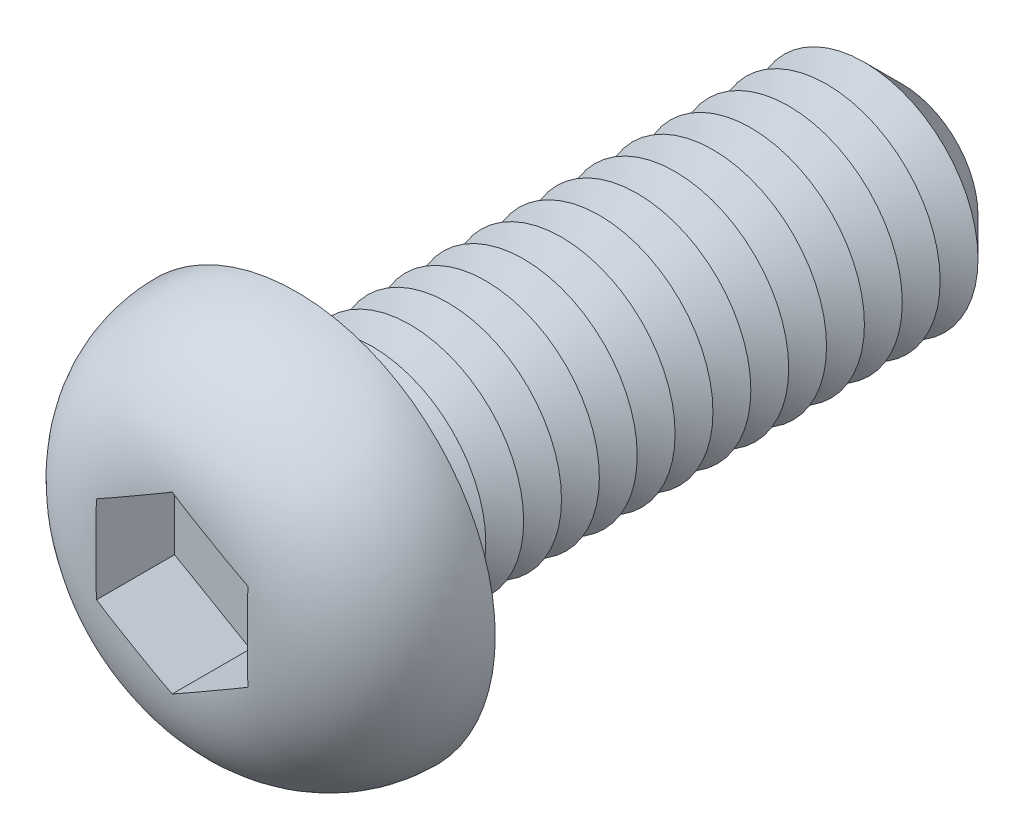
ISO-10303-21;
HEADER;
FILE_DESCRIPTION(('STEP AP214'),'2;1');
FILE_NAME('part.step','',(''),(''),'','','');
FILE_SCHEMA(('AUTOMOTIVE_DESIGN { 1 0 10303 214 1 1 1 1 }'));
ENDSEC;
DATA;
#1=APPLICATION_CONTEXT('core data for automotive mechanical design processes');
#2=APPLICATION_PROTOCOL_DEFINITION('international standard','automotive_design',2000,#1);
#3=PRODUCT_CONTEXT('',#1,'mechanical');
#4=PRODUCT('Part','Part','',(#3));
#5=PRODUCT_RELATED_PRODUCT_CATEGORY('part','',(#4));
#6=PRODUCT_DEFINITION_FORMATION('','',#4);
#7=PRODUCT_DEFINITION_CONTEXT('part definition',#1,'design');
#8=PRODUCT_DEFINITION('design','',#6,#7);
#9=PRODUCT_DEFINITION_SHAPE('','',#8);
#10=(LENGTH_UNIT() NAMED_UNIT(*) SI_UNIT(.MILLI.,.METRE.));
#11=(NAMED_UNIT(*) PLANE_ANGLE_UNIT() SI_UNIT($,.RADIAN.));
#12=(NAMED_UNIT(*) SI_UNIT($,.STERADIAN.) SOLID_ANGLE_UNIT());
#13=UNCERTAINTY_MEASURE_WITH_UNIT(LENGTH_MEASURE(1.E-05),#10,'distance_accuracy_value','');
#14=(GEOMETRIC_REPRESENTATION_CONTEXT(3) GLOBAL_UNCERTAINTY_ASSIGNED_CONTEXT((#13)) GLOBAL_UNIT_ASSIGNED_CONTEXT((#10,
#11,#12)) REPRESENTATION_CONTEXT('',''));
#15=CARTESIAN_POINT('',(0.,0.,0.));
#16=DIRECTION('',(0.,0.,1.));
#17=DIRECTION('',(1.,0.,0.));
#18=AXIS2_PLACEMENT_3D('',#15,#16,#17);
#19=CARTESIAN_POINT('',(0.,0.,-16.));
#20=DIRECTION('',(0.,0.,1.));
#21=DIRECTION('',(1.,0.,0.));
#22=AXIS2_PLACEMENT_3D('',#19,#20,#21);
#23=CYLINDRICAL_SURFACE('',#22,3.);
#24=CARTESIAN_POINT('',(0.,0.,-0.5));
#25=DIRECTION('',(0.,0.,1.));
#26=DIRECTION('',(1.,0.,0.));
#27=AXIS2_PLACEMENT_3D('',#24,#25,#26);
#28=CIRCLE('',#27,3.);
#29=CARTESIAN_POINT('',(3.,0.,-0.5));
#30=VERTEX_POINT('',#29);
#31=EDGE_CURVE('E48',#30,#30,#28,.F.);
#32=ORIENTED_EDGE('',*,*,#31,.T.);
#33=EDGE_LOOP('',(#32));
#34=FACE_BOUND('',#33,.T.);
#35=CARTESIAN_POINT('',(0.,0.,-1.));
#36=DIRECTION('',(0.,0.,1.));
#37=DIRECTION('',(1.,0.,0.));
#38=AXIS2_PLACEMENT_3D('',#35,#36,#37);
#39=CIRCLE('',#38,3.);
#40=CARTESIAN_POINT('',(3.,0.,-1.));
#41=VERTEX_POINT('',#40);
#42=EDGE_CURVE('E118',#41,#41,#39,.T.);
#43=ORIENTED_EDGE('',*,*,#42,.T.);
#44=EDGE_LOOP('',(#43));
#45=FACE_BOUND('',#44,.T.);
#46=ADVANCED_FACE('F39',(#34,#45),#23,.T.);
#47=CARTESIAN_POINT('',(0.,5.25,0.));
#48=DIRECTION('',(0.,0.,1.));
#49=DIRECTION('',(1.,0.,0.));
#50=AXIS2_PLACEMENT_3D('',#47,#48,#49);
#51=PLANE('',#50);
#52=CARTESIAN_POINT('',(0.,0.,0.));
#53=DIRECTION('',(0.,0.,1.));
#54=DIRECTION('',(1.,0.,0.));
#55=AXIS2_PLACEMENT_3D('',#52,#53,#54);
#56=CIRCLE('',#55,3.5);
#57=CARTESIAN_POINT('',(3.5,0.,0.));
#58=VERTEX_POINT('',#57);
#59=EDGE_CURVE('E11',#58,#58,#56,.T.);
#60=ORIENTED_EDGE('',*,*,#59,.T.);
#61=EDGE_LOOP('',(#60));
#62=FACE_BOUND('',#61,.T.);
#63=CARTESIAN_POINT('',(0.,0.,0.));
#64=DIRECTION('',(0.,0.,1.));
#65=DIRECTION('',(1.,0.,0.));
#66=AXIS2_PLACEMENT_3D('',#63,#64,#65);
#67=CIRCLE('',#66,5.25);
#68=CARTESIAN_POINT('',(5.25,0.,0.));
#69=VERTEX_POINT('',#68);
#70=EDGE_CURVE('E142',#69,#69,#67,.T.);
#71=ORIENTED_EDGE('',*,*,#70,.F.);
#72=EDGE_LOOP('',(#71));
#73=FACE_BOUND('',#72,.T.);
#74=ADVANCED_FACE('F218',(#62,#73),#51,.F.);
#75=CARTESIAN_POINT('',(0.,0.,0.));
#76=DIRECTION('',(0.,0.,1.));
#77=DIRECTION('',(1.,0.,0.));
#78=AXIS2_PLACEMENT_3D('',#75,#76,#77);
#79=DEGENERATE_TOROIDAL_SURFACE('',#78,1.95,3.3,.T.);
#80=CARTESIAN_POINT('',(-2.0002,1.15458506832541,3.28035788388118));
#81=CARTESIAN_POINT('',(-1.91691288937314,1.20267090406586,3.28561413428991));
#82=CARTESIAN_POINT('',(-1.83357497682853,1.25078607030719,3.2893341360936));
#83=CARTESIAN_POINT('',(-1.66686712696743,1.34703489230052,3.29467873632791));
#84=CARTESIAN_POINT('',(-1.58349720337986,1.39516854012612,3.29630387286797));
#85=CARTESIAN_POINT('',(-1.4167768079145,1.49142460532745,3.29843721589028));
#86=CARTESIAN_POINT('',(-1.33342633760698,1.53954702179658,3.29894575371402));
#87=CARTESIAN_POINT('',(-1.16671724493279,1.63579656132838,3.29953775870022));
#88=CARTESIAN_POINT('',(-1.0833586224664,1.68392368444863,3.29962119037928));
#89=CARTESIAN_POINT('',(-0.916641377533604,1.78017793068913,3.29962119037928));
#90=CARTESIAN_POINT('',(-0.833282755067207,1.82830505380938,3.29953775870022));
#91=CARTESIAN_POINT('',(-0.666573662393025,1.92455459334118,3.29894575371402));
#92=CARTESIAN_POINT('',(-0.5832231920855,1.97267700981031,3.29843721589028));
#93=CARTESIAN_POINT('',(-0.416502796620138,2.06893307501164,3.29630387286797));
#94=CARTESIAN_POINT('',(-0.333132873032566,2.11706672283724,3.29467873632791));
#95=CARTESIAN_POINT('',(-0.166425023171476,2.21331554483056,3.2893341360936));
#96=CARTESIAN_POINT('',(-0.083087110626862,2.2614307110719,3.28561413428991));
#97=CARTESIAN_POINT('',(0.000200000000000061,2.30951654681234,3.28035788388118));
#98=B_SPLINE_CURVE_WITH_KNOTS('',3,(#80,#81,#82,#83,#84,#85,#86,#87,#88,#89,#90,#91,#92,#93,#94,
#95,#96,#97),.UNSPECIFIED.,.F.,.F.,(4,2,2,2,2,2,2,2,4),(0.,0.288898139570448,0.577722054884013,
0.866460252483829,1.15522255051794,1.44398484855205,1.73272304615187,2.02154696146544,
2.31044510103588),.UNSPECIFIED.);
#99=CARTESIAN_POINT('',(-2.,1.15470053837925,3.28037053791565));
#100=VERTEX_POINT('',#99);
#101=CARTESIAN_POINT('',(0.,2.3094010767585,3.28037053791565));
#102=VERTEX_POINT('',#101);
#103=EDGE_CURVE('E159',#100,#102,#98,.T.);
#104=ORIENTED_EDGE('',*,*,#103,.T.);
#105=CARTESIAN_POINT('',(-0.000199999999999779,2.30951654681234,3.28035788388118));
#106=CARTESIAN_POINT('',(0.0830871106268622,2.2614307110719,3.28561413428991));
#107=CARTESIAN_POINT('',(0.166425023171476,2.21331554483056,3.2893341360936));
#108=CARTESIAN_POINT('',(0.333132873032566,2.11706672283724,3.29467873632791));
#109=CARTESIAN_POINT('',(0.416502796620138,2.06893307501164,3.29630387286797));
#110=CARTESIAN_POINT('',(0.5832231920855,1.97267700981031,3.29843721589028));
#111=CARTESIAN_POINT('',(0.666573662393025,1.92455459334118,3.29894575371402));
#112=CARTESIAN_POINT('',(0.833282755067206,1.82830505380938,3.29953775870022));
#113=CARTESIAN_POINT('',(0.916641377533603,1.78017793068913,3.29962119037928));
#114=CARTESIAN_POINT('',(1.0833586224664,1.68392368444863,3.29962119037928));
#115=CARTESIAN_POINT('',(1.16671724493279,1.63579656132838,3.29953775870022));
#116=CARTESIAN_POINT('',(1.33342633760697,1.53954702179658,3.29894575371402));
#117=CARTESIAN_POINT('',(1.4167768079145,1.49142460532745,3.29843721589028));
#118=CARTESIAN_POINT('',(1.58349720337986,1.39516854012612,3.29630387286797));
#119=CARTESIAN_POINT('',(1.66686712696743,1.34703489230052,3.29467873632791));
#120=CARTESIAN_POINT('',(1.83357497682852,1.25078607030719,3.2893341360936));
#121=CARTESIAN_POINT('',(1.91691288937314,1.20267090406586,3.28561413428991));
#122=CARTESIAN_POINT('',(2.0002,1.15458506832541,3.28035788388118));
#123=B_SPLINE_CURVE_WITH_KNOTS('',3,(#105,#106,#107,#108,#109,#110,#111,#112,#113,#114,#115,
#116,#117,#118,#119,#120,#121,#122),.UNSPECIFIED.,.F.,.F.,(4,2,2,2,2,2,2,2,4),(0.,
0.288898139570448,0.577722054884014,0.866460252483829,1.15522255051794,1.44398484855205,
1.73272304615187,2.02154696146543,2.31044510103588),.UNSPECIFIED.);
#124=CARTESIAN_POINT('',(2.,1.15470053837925,3.28037053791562));
#125=VERTEX_POINT('',#124);
#126=EDGE_CURVE('E98',#102,#125,#123,.T.);
#127=ORIENTED_EDGE('',*,*,#126,.T.);
#128=CARTESIAN_POINT('',(2.,0.,3.29962119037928));
#129=CARTESIAN_POINT('',(2.,-0.083776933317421,3.29962202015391));
#130=CARTESIAN_POINT('',(2.,-0.16755385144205,3.29955399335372));
#131=CARTESIAN_POINT('',(2.,-0.335108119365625,3.29913665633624));
#132=CARTESIAN_POINT('',(2.,-0.418885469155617,3.29878734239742));
#133=CARTESIAN_POINT('',(2.,-0.58647412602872,3.29739645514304));
#134=CARTESIAN_POINT('',(2.,-0.670285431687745,3.29635457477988));
#135=CARTESIAN_POINT('',(2.,-0.83788107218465,3.29299045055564));
#136=CARTESIAN_POINT('',(2.,-0.921665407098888,3.29066821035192));
#137=CARTESIAN_POINT('',(2.,-1.1722454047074,3.2807858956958));
#138=CARTESIAN_POINT('',(2.,-1.33895832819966,3.27031526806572));
#139=CARTESIAN_POINT('',(2.,-1.67103623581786,3.23635494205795));
#140=CARTESIAN_POINT('',(2.,-1.83640244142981,3.21287879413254));
#141=CARTESIAN_POINT('',(2.,-2.10344176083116,3.16074182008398));
#142=CARTESIAN_POINT('',(2.,-2.2061099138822,3.13718731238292));
#143=CARTESIAN_POINT('',(2.,-2.40948794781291,3.08263206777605));
#144=CARTESIAN_POINT('',(2.,-2.51019754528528,3.05163026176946));
#145=CARTESIAN_POINT('',(2.,-2.70894468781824,2.98167613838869));
#146=CARTESIAN_POINT('',(2.,-2.80697949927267,2.94271600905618));
#147=CARTESIAN_POINT('',(2.,-2.9994014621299,2.85662314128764));
#148=CARTESIAN_POINT('',(2.,-3.09378880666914,2.80949083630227));
#149=CARTESIAN_POINT('',(2.,-3.27874879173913,2.70660110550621));
#150=CARTESIAN_POINT('',(2.,-3.36928473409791,2.6507774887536));
#151=CARTESIAN_POINT('',(2.,-3.54476824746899,2.53095107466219));
#152=CARTESIAN_POINT('',(2.,-3.6297163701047,2.46694908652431));
#153=CARTESIAN_POINT('',(2.,-3.79309021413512,2.33110056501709));
#154=CARTESIAN_POINT('',(2.,-3.87151694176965,2.25925524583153));
#155=CARTESIAN_POINT('',(2.,-4.02093628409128,2.10826339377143));
#156=CARTESIAN_POINT('',(2.,-4.09192987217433,2.02911781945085));
#157=CARTESIAN_POINT('',(2.,-4.27732278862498,1.8003635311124));
#158=CARTESIAN_POINT('',(2.,-4.38297261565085,1.64348590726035));
#159=CARTESIAN_POINT('',(2.,-4.564185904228,1.31336862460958));
#160=CARTESIAN_POINT('',(2.,-4.63976443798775,1.14013721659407));
#161=CARTESIAN_POINT('',(2.,-4.75417820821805,0.794488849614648));
#162=CARTESIAN_POINT('',(2.,-4.79509243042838,0.622758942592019));
#163=CARTESIAN_POINT('',(2.,-4.84679751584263,0.274828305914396));
#164=CARTESIAN_POINT('',(2.,-4.85759267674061,0.098628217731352));
#165=CARTESIAN_POINT('',(2.,-4.8487955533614,-0.249157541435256));
#166=CARTESIAN_POINT('',(2.,-4.82985906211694,-0.420760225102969));
#167=CARTESIAN_POINT('',(2.,-4.76345103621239,-0.758322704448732));
#168=CARTESIAN_POINT('',(2.,-4.71598351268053,-0.924283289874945));
#169=CARTESIAN_POINT('',(2.,-4.59404942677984,-1.24604183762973));
#170=CARTESIAN_POINT('',(2.,-4.51956988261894,-1.40183487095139));
#171=CARTESIAN_POINT('',(2.,-4.34600859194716,-1.6990817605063));
#172=CARTESIAN_POINT('',(2.,-4.24691988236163,-1.84053154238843));
#173=CARTESIAN_POINT('',(2.,-4.02493220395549,-2.10847549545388));
#174=CARTESIAN_POINT('',(2.,-3.90156532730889,-2.23458080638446));
#175=CARTESIAN_POINT('',(2.,-3.63636218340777,-2.46550695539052));
#176=CARTESIAN_POINT('',(2.,-3.49453117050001,-2.57033382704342));
#177=CARTESIAN_POINT('',(2.,-3.26713798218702,-2.7130834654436));
#178=CARTESIAN_POINT('',(2.,-3.18660091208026,-2.75923686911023));
#179=CARTESIAN_POINT('',(2.,-3.02216370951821,-2.84520816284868));
#180=CARTESIAN_POINT('',(2.,-2.93826250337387,-2.88502400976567));
#181=CARTESIAN_POINT('',(2.,-2.76779132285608,-2.95832456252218));
#182=CARTESIAN_POINT('',(2.,-2.68122238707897,-2.99181169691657));
#183=CARTESIAN_POINT('',(2.,-2.50604626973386,-3.05263810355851));
#184=CARTESIAN_POINT('',(2.,-2.41744088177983,-3.07998257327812));
#185=CARTESIAN_POINT('',(2.,-2.20396420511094,-3.13835394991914));
#186=CARTESIAN_POINT('',(2.,-2.07835656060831,-3.16669536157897));
#187=CARTESIAN_POINT('',(2.,-1.82529007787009,-3.2134938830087));
#188=CARTESIAN_POINT('',(2.,-1.69783012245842,-3.23194474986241));
#189=CARTESIAN_POINT('',(2.,-1.44149598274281,-3.26083645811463));
#190=CARTESIAN_POINT('',(2.,-1.31261808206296,-3.27124272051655));
#191=CARTESIAN_POINT('',(2.,-1.05456848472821,-3.28623769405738));
#192=CARTESIAN_POINT('',(2.,-0.925396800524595,-3.29082664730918));
#193=CARTESIAN_POINT('',(2.,-0.665550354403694,-3.29674923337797));
#194=CARTESIAN_POINT('',(2.,-0.53487497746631,-3.29804579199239));
#195=CARTESIAN_POINT('',(2.,-0.273526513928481,-3.29947536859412));
#196=CARTESIAN_POINT('',(2.,-0.142853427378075,-3.29960842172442));
#197=CARTESIAN_POINT('',(2.,0.118243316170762,-3.29963281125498));
#198=CARTESIAN_POINT('',(2.,0.248666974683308,-3.29952460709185));
#199=CARTESIAN_POINT('',(2.,0.509509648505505,-3.29825409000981));
#200=CARTESIAN_POINT('',(2.,0.639928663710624,-3.29709183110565));
#201=CARTESIAN_POINT('',(2.,0.831730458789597,-3.29304171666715));
#202=CARTESIAN_POINT('',(2.,0.89313616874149,-3.29139197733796));
#203=CARTESIAN_POINT('',(2.,1.01591282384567,-3.28711504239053));
#204=CARTESIAN_POINT('',(2.,1.07728376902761,-3.28448784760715));
#205=CARTESIAN_POINT('',(2.,1.26131335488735,-3.27473407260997));
#206=CARTESIAN_POINT('',(2.,1.38388698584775,-3.2657353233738));
#207=CARTESIAN_POINT('',(2.,1.62750125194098,-3.24079239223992));
#208=CARTESIAN_POINT('',(2.,1.74854662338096,-3.22489680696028));
#209=CARTESIAN_POINT('',(2.,1.98924449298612,-3.18452451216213));
#210=CARTESIAN_POINT('',(2.,2.10889688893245,-3.16004717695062));
#211=CARTESIAN_POINT('',(2.,2.34827145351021,-3.10067973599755));
#212=CARTESIAN_POINT('',(2.,2.46794336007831,-3.06558373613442));
#213=CARTESIAN_POINT('',(2.,2.70350765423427,-2.98433995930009));
#214=CARTESIAN_POINT('',(2.,2.8194000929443,-2.9381923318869));
#215=CARTESIAN_POINT('',(2.,3.0462872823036,-2.83430045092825));
#216=CARTESIAN_POINT('',(2.,3.157267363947,-2.77652399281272));
#217=CARTESIAN_POINT('',(2.,3.37244069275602,-2.64945989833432));
#218=CARTESIAN_POINT('',(2.,3.47663511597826,-2.58017426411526));
#219=CARTESIAN_POINT('',(2.,3.66184410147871,-2.44158969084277));
#220=CARTESIAN_POINT('',(2.,3.74400419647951,-2.37381785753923));
#221=CARTESIAN_POINT('',(2.,3.90136233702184,-2.23063102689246));
#222=CARTESIAN_POINT('',(2.,3.9765614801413,-2.1552172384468));
#223=CARTESIAN_POINT('',(2.,4.11902811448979,-1.99742327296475));
#224=CARTESIAN_POINT('',(2.,4.18630715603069,-1.91505354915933));
#225=CARTESIAN_POINT('',(2.,4.31224227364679,-1.74401295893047));
#226=CARTESIAN_POINT('',(2.,4.37089943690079,-1.65534288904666));
#227=CARTESIAN_POINT('',(2.,4.51742320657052,-1.40720395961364));
#228=CARTESIAN_POINT('',(2.,4.59632371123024,-1.24230503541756));
#229=CARTESIAN_POINT('',(2.,4.72377654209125,-0.901269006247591));
#230=CARTESIAN_POINT('',(2.,4.77233626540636,-0.725134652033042));
#231=CARTESIAN_POINT('',(2.,4.83594291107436,-0.375162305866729));
#232=CARTESIAN_POINT('',(2.,4.85240855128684,-0.201581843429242));
#233=CARTESIAN_POINT('',(2.,4.85558073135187,0.145835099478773));
#234=CARTESIAN_POINT('',(2.,4.8422910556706,0.319671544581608));
#235=CARTESIAN_POINT('',(2.,4.78674180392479,0.660539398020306));
#236=CARTESIAN_POINT('',(2.,4.74482430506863,0.827626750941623));
#237=CARTESIAN_POINT('',(2.,4.63375789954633,1.15246461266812));
#238=CARTESIAN_POINT('',(2.,4.56461058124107,1.31021566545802));
#239=CARTESIAN_POINT('',(2.,4.40063624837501,1.61344814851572));
#240=CARTESIAN_POINT('',(2.,4.30559842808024,1.75881539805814));
#241=CARTESIAN_POINT('',(2.,4.09315528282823,2.03216183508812));
#242=CARTESIAN_POINT('',(2.,3.97574503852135,2.16013718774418));
#243=CARTESIAN_POINT('',(2.,3.71810418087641,2.3997527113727));
#244=CARTESIAN_POINT('',(2.,3.57725563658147,2.51072635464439));
#245=CARTESIAN_POINT('',(2.,3.28005668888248,2.70933274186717));
#246=CARTESIAN_POINT('',(2.,3.12370896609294,2.79696951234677));
#247=CARTESIAN_POINT('',(2.,2.85462284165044,2.92305372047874));
#248=CARTESIAN_POINT('',(2.,2.74490899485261,2.96813077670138));
#249=CARTESIAN_POINT('',(2.,2.52184151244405,3.04824715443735));
#250=CARTESIAN_POINT('',(2.,2.40848685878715,3.08328364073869));
#251=CARTESIAN_POINT('',(2.,2.17918323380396,3.14397693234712));
#252=CARTESIAN_POINT('',(2.,2.06323128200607,3.16962230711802));
#253=CARTESIAN_POINT('',(2.,1.82982653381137,3.21251895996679));
#254=CARTESIAN_POINT('',(2.,1.71237385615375,3.229770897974));
#255=CARTESIAN_POINT('',(2.,1.46252543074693,3.2589582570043));
#256=CARTESIAN_POINT('',(2.,1.3300298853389,3.27000580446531));
#257=CARTESIAN_POINT('',(2.,1.0646774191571,3.28585371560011));
#258=CARTESIAN_POINT('',(2.,0.931820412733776,3.29065244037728));
#259=CARTESIAN_POINT('',(2.,0.665789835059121,3.29677132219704));
#260=CARTESIAN_POINT('',(2.,0.532616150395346,3.29808470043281));
#261=CARTESIAN_POINT('',(2.,0.332868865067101,3.29913679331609));
#262=CARTESIAN_POINT('',(2.,0.266295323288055,3.2993345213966));
#263=CARTESIAN_POINT('',(2.,0.133147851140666,3.29957639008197));
#264=CARTESIAN_POINT('',(2.,0.0665739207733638,3.29962053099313));
#265=CARTESIAN_POINT('',(2.,0.,3.29962119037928));
#266=B_SPLINE_CURVE_WITH_KNOTS('',3,(#128,#129,#130,#131,#132,#133,#134,#135,#136,#137,#138,
#139,#140,#141,#142,#143,#144,#145,#146,#147,#148,#149,#150,#151,#152,#153,#154,#155,#156,#157,
#158,#159,#160,#161,#162,#163,#164,#165,#166,#167,#168,#169,#170,#171,#172,#173,#174,#175,#176,
#177,#178,#179,#180,#181,#182,#183,#184,#185,#186,#187,#188,#189,#190,#191,#192,#193,#194,#195,
#196,#197,#198,#199,#200,#201,#202,#203,#204,#205,#206,#207,#208,#209,#210,#211,#212,#213,#214,
#215,#216,#217,#218,#219,#220,#221,#222,#223,#224,#225,#226,#227,#228,#229,#230,#231,#232,#233,
#234,#235,#236,#237,#238,#239,#240,#241,#242,#243,#244,#245,#246,#247,#248,#249,#250,#251,#252,
#253,#254,#255,#256,#257,#258,#259,#260,#261,#262,#263,#264,#265),.UNSPECIFIED.,.T.,.F.,(4,2,2,
2,2,2,2,2,2,2,2,2,2,2,2,2,2,2,2,2,2,2,2,2,2,2,2,2,2,2,2,2,2,2,2,2,2,2,2,2,2,2,2,2,2,2,2,2,2,2,2,
2,2,2,2,2,2,2,2,2,2,2,2,2,2,2,2,2,4),(0.,0.251330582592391,0.502664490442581,0.754109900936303,
1.00555459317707,1.50637447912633,2.00667353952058,2.32243701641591,2.63824585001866,
2.95436618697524,3.27046976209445,3.58911045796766,3.90771965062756,4.22627959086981,
4.5447977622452,5.10896009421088,5.67283930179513,6.19985685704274,6.72679920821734,
7.24228104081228,7.75769041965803,8.27334782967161,8.78915130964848,9.3160918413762,
9.84288274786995,10.1211212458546,10.3994492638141,10.6776702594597,10.9556549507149,
11.3414617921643,11.727511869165,12.1152122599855,12.5028965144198,12.8949273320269,
13.2869463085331,13.6782193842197,14.0694724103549,14.2537488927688,14.4380252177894,
14.8065831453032,15.1725852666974,15.5386140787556,15.9122523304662,16.28588552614,
16.6605680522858,17.0351854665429,17.3542226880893,17.6732095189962,17.9917252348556,
18.3102007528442,18.8555909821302,19.4008481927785,19.9214008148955,20.4418872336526,
20.9562606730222,21.4706041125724,21.9892675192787,22.5080451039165,23.0436926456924,
23.5792477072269,23.9346277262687,24.2901079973,24.6460195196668,25.0019030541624,
25.4005476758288,25.7992968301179,26.1988209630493,26.3985429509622,26.5982645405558),.UNSPECIFIED.);
#267=CARTESIAN_POINT('',(2.,-1.15470053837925,3.28037053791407));
#268=VERTEX_POINT('',#267);
#269=EDGE_CURVE('E63',#125,#268,#266,.T.);
#270=ORIENTED_EDGE('',*,*,#269,.T.);
#271=CARTESIAN_POINT('',(2.0002,-1.15458506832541,3.28035788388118));
#272=CARTESIAN_POINT('',(1.91691288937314,-1.20267090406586,3.28561413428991));
#273=CARTESIAN_POINT('',(1.83357497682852,-1.25078607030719,3.2893341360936));
#274=CARTESIAN_POINT('',(1.66686712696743,-1.34703489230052,3.29467873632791));
#275=CARTESIAN_POINT('',(1.58349720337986,-1.39516854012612,3.29630387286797));
#276=CARTESIAN_POINT('',(1.4167768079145,-1.49142460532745,3.29843721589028));
#277=CARTESIAN_POINT('',(1.33342633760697,-1.53954702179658,3.29894575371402));
#278=CARTESIAN_POINT('',(1.16671724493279,-1.63579656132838,3.29953775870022));
#279=CARTESIAN_POINT('',(1.0833586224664,-1.68392368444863,3.29962119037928));
#280=CARTESIAN_POINT('',(0.916641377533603,-1.78017793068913,3.29962119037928));
#281=CARTESIAN_POINT('',(0.833282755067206,-1.82830505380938,3.29953775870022));
#282=CARTESIAN_POINT('',(0.666573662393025,-1.92455459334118,3.29894575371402));
#283=CARTESIAN_POINT('',(0.5832231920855,-1.97267700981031,3.29843721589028));
#284=CARTESIAN_POINT('',(0.416502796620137,-2.06893307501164,3.29630387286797));
#285=CARTESIAN_POINT('',(0.333132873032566,-2.11706672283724,3.29467873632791));
#286=CARTESIAN_POINT('',(0.166425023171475,-2.21331554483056,3.2893341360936));
#287=CARTESIAN_POINT('',(0.0830871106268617,-2.2614307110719,3.28561413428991));
#288=CARTESIAN_POINT('',(-0.000200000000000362,-2.30951654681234,3.28035788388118));
#289=B_SPLINE_CURVE_WITH_KNOTS('',3,(#271,#272,#273,#274,#275,#276,#277,#278,#279,#280,#281,
#282,#283,#284,#285,#286,#287,#288),.UNSPECIFIED.,.F.,.F.,(4,2,2,2,2,2,2,2,4),(0.,
0.288898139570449,0.577722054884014,0.86646025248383,1.15522255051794,1.44398484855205,
1.73272304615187,2.02154696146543,2.31044510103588),.UNSPECIFIED.);
#290=CARTESIAN_POINT('',(0.,-2.3094010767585,3.28037053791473));
#291=VERTEX_POINT('',#290);
#292=EDGE_CURVE('E239',#268,#291,#289,.T.);
#293=ORIENTED_EDGE('',*,*,#292,.T.);
#294=CARTESIAN_POINT('',(0.000199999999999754,-2.30951654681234,3.28035788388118));
#295=CARTESIAN_POINT('',(-0.0830871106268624,-2.2614307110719,3.28561413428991));
#296=CARTESIAN_POINT('',(-0.166425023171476,-2.21331554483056,3.2893341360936));
#297=CARTESIAN_POINT('',(-0.333132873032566,-2.11706672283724,3.29467873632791));
#298=CARTESIAN_POINT('',(-0.416502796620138,-2.06893307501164,3.29630387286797));
#299=CARTESIAN_POINT('',(-0.5832231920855,-1.97267700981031,3.29843721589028));
#300=CARTESIAN_POINT('',(-0.666573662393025,-1.92455459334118,3.29894575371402));
#301=CARTESIAN_POINT('',(-0.833282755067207,-1.82830505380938,3.29953775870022));
#302=CARTESIAN_POINT('',(-0.916641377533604,-1.78017793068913,3.29962119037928));
#303=CARTESIAN_POINT('',(-1.0833586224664,-1.68392368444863,3.29962119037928));
#304=CARTESIAN_POINT('',(-1.16671724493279,-1.63579656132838,3.29953775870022));
#305=CARTESIAN_POINT('',(-1.33342633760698,-1.53954702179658,3.29894575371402));
#306=CARTESIAN_POINT('',(-1.4167768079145,-1.49142460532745,3.29843721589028));
#307=CARTESIAN_POINT('',(-1.58349720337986,-1.39516854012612,3.29630387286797));
#308=CARTESIAN_POINT('',(-1.66686712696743,-1.34703489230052,3.29467873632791));
#309=CARTESIAN_POINT('',(-1.83357497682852,-1.25078607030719,3.2893341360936));
#310=CARTESIAN_POINT('',(-1.91691288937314,-1.20267090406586,3.28561413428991));
#311=CARTESIAN_POINT('',(-2.0002,-1.15458506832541,3.28035788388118));
#312=B_SPLINE_CURVE_WITH_KNOTS('',3,(#294,#295,#296,#297,#298,#299,#300,#301,#302,#303,#304,
#305,#306,#307,#308,#309,#310,#311),.UNSPECIFIED.,.F.,.F.,(4,2,2,2,2,2,2,2,4),(0.,
0.288898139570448,0.577722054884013,0.866460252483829,1.15522255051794,1.44398484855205,
1.73272304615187,2.02154696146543,2.31044510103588),.UNSPECIFIED.);
#313=CARTESIAN_POINT('',(-2.,-1.15470053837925,3.28037053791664));
#314=VERTEX_POINT('',#313);
#315=EDGE_CURVE('E245',#291,#314,#312,.T.);
#316=ORIENTED_EDGE('',*,*,#315,.T.);
#317=CARTESIAN_POINT('',(-2.,0.,3.29962119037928));
#318=CARTESIAN_POINT('',(-2.,0.083776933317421,3.29962202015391));
#319=CARTESIAN_POINT('',(-2.,0.16755385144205,3.29955399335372));
#320=CARTESIAN_POINT('',(-2.,0.335108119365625,3.29913665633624));
#321=CARTESIAN_POINT('',(-2.,0.418885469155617,3.29878734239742));
#322=CARTESIAN_POINT('',(-2.,0.58647412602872,3.29739645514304));
#323=CARTESIAN_POINT('',(-2.,0.670285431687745,3.29635457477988));
#324=CARTESIAN_POINT('',(-2.,0.83788107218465,3.29299045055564));
#325=CARTESIAN_POINT('',(-2.,0.921665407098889,3.29066821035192));
#326=CARTESIAN_POINT('',(-2.,1.1722454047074,3.2807858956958));
#327=CARTESIAN_POINT('',(-2.,1.33895832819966,3.27031526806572));
#328=CARTESIAN_POINT('',(-2.,1.67103623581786,3.23635494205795));
#329=CARTESIAN_POINT('',(-2.,1.83640244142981,3.21287879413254));
#330=CARTESIAN_POINT('',(-2.,2.10344176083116,3.16074182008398));
#331=CARTESIAN_POINT('',(-2.,2.2061099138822,3.13718731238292));
#332=CARTESIAN_POINT('',(-2.,2.40948794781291,3.08263206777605));
#333=CARTESIAN_POINT('',(-2.,2.51019754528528,3.05163026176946));
#334=CARTESIAN_POINT('',(-2.,2.70894468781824,2.98167613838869));
#335=CARTESIAN_POINT('',(-2.,2.80697949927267,2.94271600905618));
#336=CARTESIAN_POINT('',(-2.,2.9994014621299,2.85662314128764));
#337=CARTESIAN_POINT('',(-2.,3.09378880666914,2.80949083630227));
#338=CARTESIAN_POINT('',(-2.,3.27874879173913,2.70660110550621));
#339=CARTESIAN_POINT('',(-2.,3.36928473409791,2.6507774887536));
#340=CARTESIAN_POINT('',(-2.,3.54476824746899,2.53095107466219));
#341=CARTESIAN_POINT('',(-2.,3.6297163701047,2.46694908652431));
#342=CARTESIAN_POINT('',(-2.,3.79309021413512,2.33110056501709));
#343=CARTESIAN_POINT('',(-2.,3.87151694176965,2.25925524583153));
#344=CARTESIAN_POINT('',(-2.,4.02093628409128,2.10826339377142));
#345=CARTESIAN_POINT('',(-2.,4.09192987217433,2.02911781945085));
#346=CARTESIAN_POINT('',(-2.,4.27732278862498,1.8003635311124));
#347=CARTESIAN_POINT('',(-2.,4.38297261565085,1.64348590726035));
#348=CARTESIAN_POINT('',(-2.,4.564185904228,1.31336862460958));
#349=CARTESIAN_POINT('',(-2.,4.63976443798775,1.14013721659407));
#350=CARTESIAN_POINT('',(-2.,4.75417820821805,0.794488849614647));
#351=CARTESIAN_POINT('',(-2.,4.79509243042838,0.622758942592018));
#352=CARTESIAN_POINT('',(-2.,4.84679751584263,0.274828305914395));
#353=CARTESIAN_POINT('',(-2.,4.85759267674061,0.0986282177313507));
#354=CARTESIAN_POINT('',(-2.,4.8487955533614,-0.249157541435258));
#355=CARTESIAN_POINT('',(-2.,4.82985906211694,-0.42076022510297));
#356=CARTESIAN_POINT('',(-2.,4.76345103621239,-0.758322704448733));
#357=CARTESIAN_POINT('',(-2.,4.71598351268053,-0.924283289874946));
#358=CARTESIAN_POINT('',(-2.,4.59404942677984,-1.24604183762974));
#359=CARTESIAN_POINT('',(-2.,4.51956988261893,-1.40183487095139));
#360=CARTESIAN_POINT('',(-2.,4.34600859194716,-1.6990817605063));
#361=CARTESIAN_POINT('',(-2.,4.24691988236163,-1.84053154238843));
#362=CARTESIAN_POINT('',(-2.,4.02493220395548,-2.10847549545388));
#363=CARTESIAN_POINT('',(-2.,3.90156532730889,-2.23458080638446));
#364=CARTESIAN_POINT('',(-2.,3.63636218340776,-2.46550695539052));
#365=CARTESIAN_POINT('',(-2.,3.49453117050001,-2.57033382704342));
#366=CARTESIAN_POINT('',(-2.,3.26713798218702,-2.7130834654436));
#367=CARTESIAN_POINT('',(-2.,3.18660091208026,-2.75923686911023));
#368=CARTESIAN_POINT('',(-2.,3.02216370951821,-2.84520816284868));
#369=CARTESIAN_POINT('',(-2.,2.93826250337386,-2.88502400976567));
#370=CARTESIAN_POINT('',(-2.,2.76779132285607,-2.95832456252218));
#371=CARTESIAN_POINT('',(-2.,2.68122238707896,-2.99181169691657));
#372=CARTESIAN_POINT('',(-2.,2.50604626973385,-3.05263810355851));
#373=CARTESIAN_POINT('',(-2.,2.41744088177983,-3.07998257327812));
#374=CARTESIAN_POINT('',(-2.,2.20396420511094,-3.13835394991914));
#375=CARTESIAN_POINT('',(-2.,2.0783565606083,-3.16669536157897));
#376=CARTESIAN_POINT('',(-2.,1.82529007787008,-3.2134938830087));
#377=CARTESIAN_POINT('',(-2.,1.69783012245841,-3.23194474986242));
#378=CARTESIAN_POINT('',(-2.,1.4414959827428,-3.26083645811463));
#379=CARTESIAN_POINT('',(-2.,1.31261808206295,-3.27124272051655));
#380=CARTESIAN_POINT('',(-2.,1.0545684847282,-3.28623769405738));
#381=CARTESIAN_POINT('',(-2.,0.925396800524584,-3.29082664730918));
#382=CARTESIAN_POINT('',(-2.,0.665550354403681,-3.29674923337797));
#383=CARTESIAN_POINT('',(-2.,0.534874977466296,-3.29804579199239));
#384=CARTESIAN_POINT('',(-2.,0.273526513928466,-3.29947536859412));
#385=CARTESIAN_POINT('',(-2.,0.142853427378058,-3.29960842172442));
#386=CARTESIAN_POINT('',(-2.,-0.11824331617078,-3.29963281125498));
#387=CARTESIAN_POINT('',(-2.,-0.248666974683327,-3.29952460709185));
#388=CARTESIAN_POINT('',(-2.,-0.509509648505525,-3.29825409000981));
#389=CARTESIAN_POINT('',(-2.,-0.639928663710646,-3.29709183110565));
#390=CARTESIAN_POINT('',(-2.,-0.83173045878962,-3.29304171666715));
#391=CARTESIAN_POINT('',(-2.,-0.893136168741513,-3.29139197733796));
#392=CARTESIAN_POINT('',(-2.,-1.0159128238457,-3.28711504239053));
#393=CARTESIAN_POINT('',(-2.,-1.07728376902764,-3.28448784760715));
#394=CARTESIAN_POINT('',(-2.,-1.26131335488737,-3.27473407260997));
#395=CARTESIAN_POINT('',(-2.,-1.38388698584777,-3.2657353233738));
#396=CARTESIAN_POINT('',(-2.,-1.627501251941,-3.24079239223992));
#397=CARTESIAN_POINT('',(-2.,-1.74854662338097,-3.22489680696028));
#398=CARTESIAN_POINT('',(-2.,-1.98924449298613,-3.18452451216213));
#399=CARTESIAN_POINT('',(-2.,-2.10889688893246,-3.16004717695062));
#400=CARTESIAN_POINT('',(-2.,-2.34827145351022,-3.10067973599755));
#401=CARTESIAN_POINT('',(-2.,-2.46794336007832,-3.06558373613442));
#402=CARTESIAN_POINT('',(-2.,-2.70350765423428,-2.98433995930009));
#403=CARTESIAN_POINT('',(-2.,-2.81940009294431,-2.93819233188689));
#404=CARTESIAN_POINT('',(-2.,-3.0462872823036,-2.83430045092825));
#405=CARTESIAN_POINT('',(-2.,-3.157267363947,-2.77652399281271));
#406=CARTESIAN_POINT('',(-2.,-3.37244069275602,-2.64945989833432));
#407=CARTESIAN_POINT('',(-2.,-3.47663511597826,-2.58017426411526));
#408=CARTESIAN_POINT('',(-2.,-3.66184410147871,-2.44158969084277));
#409=CARTESIAN_POINT('',(-2.,-3.74400419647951,-2.37381785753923));
#410=CARTESIAN_POINT('',(-2.,-3.90136233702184,-2.23063102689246));
#411=CARTESIAN_POINT('',(-2.,-3.9765614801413,-2.1552172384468));
#412=CARTESIAN_POINT('',(-2.,-4.11902811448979,-1.99742327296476));
#413=CARTESIAN_POINT('',(-2.,-4.18630715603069,-1.91505354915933));
#414=CARTESIAN_POINT('',(-2.,-4.31224227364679,-1.74401295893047));
#415=CARTESIAN_POINT('',(-2.,-4.37089943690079,-1.65534288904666));
#416=CARTESIAN_POINT('',(-2.,-4.51742320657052,-1.40720395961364));
#417=CARTESIAN_POINT('',(-2.,-4.59632371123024,-1.24230503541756));
#418=CARTESIAN_POINT('',(-2.,-4.72377654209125,-0.901269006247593));
#419=CARTESIAN_POINT('',(-2.,-4.77233626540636,-0.725134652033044));
#420=CARTESIAN_POINT('',(-2.,-4.83594291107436,-0.37516230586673));
#421=CARTESIAN_POINT('',(-2.,-4.85240855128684,-0.201581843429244));
#422=CARTESIAN_POINT('',(-2.,-4.85558073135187,0.145835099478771));
#423=CARTESIAN_POINT('',(-2.,-4.8422910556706,0.319671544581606));
#424=CARTESIAN_POINT('',(-2.,-4.78674180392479,0.660539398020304));
#425=CARTESIAN_POINT('',(-2.,-4.74482430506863,0.827626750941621));
#426=CARTESIAN_POINT('',(-2.,-4.63375789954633,1.15246461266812));
#427=CARTESIAN_POINT('',(-2.,-4.56461058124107,1.31021566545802));
#428=CARTESIAN_POINT('',(-2.,-4.40063624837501,1.61344814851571));
#429=CARTESIAN_POINT('',(-2.,-4.30559842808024,1.75881539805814));
#430=CARTESIAN_POINT('',(-2.,-4.09315528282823,2.03216183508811));
#431=CARTESIAN_POINT('',(-2.,-3.97574503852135,2.16013718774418));
#432=CARTESIAN_POINT('',(-2.,-3.71810418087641,2.39975271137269));
#433=CARTESIAN_POINT('',(-2.,-3.57725563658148,2.51072635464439));
#434=CARTESIAN_POINT('',(-2.,-3.28005668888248,2.70933274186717));
#435=CARTESIAN_POINT('',(-2.,-3.12370896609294,2.79696951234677));
#436=CARTESIAN_POINT('',(-2.,-2.85462284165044,2.92305372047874));
#437=CARTESIAN_POINT('',(-2.,-2.74490899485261,2.96813077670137));
#438=CARTESIAN_POINT('',(-2.,-2.52184151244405,3.04824715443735));
#439=CARTESIAN_POINT('',(-2.,-2.40848685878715,3.08328364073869));
#440=CARTESIAN_POINT('',(-2.,-2.17918323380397,3.14397693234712));
#441=CARTESIAN_POINT('',(-2.,-2.06323128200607,3.16962230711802));
#442=CARTESIAN_POINT('',(-2.,-1.82982653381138,3.21251895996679));
#443=CARTESIAN_POINT('',(-2.,-1.71237385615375,3.229770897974));
#444=CARTESIAN_POINT('',(-2.,-1.46252543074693,3.2589582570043));
#445=CARTESIAN_POINT('',(-2.,-1.33002988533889,3.27000580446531));
#446=CARTESIAN_POINT('',(-2.,-1.0646774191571,3.28585371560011));
#447=CARTESIAN_POINT('',(-2.,-0.931820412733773,3.29065244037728));
#448=CARTESIAN_POINT('',(-2.,-0.66578983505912,3.29677132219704));
#449=CARTESIAN_POINT('',(-2.,-0.532616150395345,3.29808470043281));
#450=CARTESIAN_POINT('',(-2.,-0.332868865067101,3.29913679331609));
#451=CARTESIAN_POINT('',(-2.,-0.266295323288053,3.2993345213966));
#452=CARTESIAN_POINT('',(-2.,-0.133147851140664,3.29957639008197));
#453=CARTESIAN_POINT('',(-2.,-0.0665739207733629,3.29962053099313));
#454=CARTESIAN_POINT('',(-2.,0.,3.29962119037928));
#455=B_SPLINE_CURVE_WITH_KNOTS('',3,(#317,#318,#319,#320,#321,#322,#323,#324,#325,#326,#327,
#328,#329,#330,#331,#332,#333,#334,#335,#336,#337,#338,#339,#340,#341,#342,#343,#344,#345,#346,
#347,#348,#349,#350,#351,#352,#353,#354,#355,#356,#357,#358,#359,#360,#361,#362,#363,#364,#365,
#366,#367,#368,#369,#370,#371,#372,#373,#374,#375,#376,#377,#378,#379,#380,#381,#382,#383,#384,
#385,#386,#387,#388,#389,#390,#391,#392,#393,#394,#395,#396,#397,#398,#399,#400,#401,#402,#403,
#404,#405,#406,#407,#408,#409,#410,#411,#412,#413,#414,#415,#416,#417,#418,#419,#420,#421,#422,
#423,#424,#425,#426,#427,#428,#429,#430,#431,#432,#433,#434,#435,#436,#437,#438,#439,#440,#441,
#442,#443,#444,#445,#446,#447,#448,#449,#450,#451,#452,#453,#454),.UNSPECIFIED.,.T.,.F.,(4,2,2,
2,2,2,2,2,2,2,2,2,2,2,2,2,2,2,2,2,2,2,2,2,2,2,2,2,2,2,2,2,2,2,2,2,2,2,2,2,2,2,2,2,2,2,2,2,2,2,2,
2,2,2,2,2,2,2,2,2,2,2,2,2,2,2,2,2,4),(0.,0.251330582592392,0.502664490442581,0.754109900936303,
1.00555459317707,1.50637447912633,2.00667353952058,2.32243701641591,2.63824585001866,
2.95436618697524,3.27046976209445,3.58911045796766,3.90771965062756,4.22627959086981,
4.5447977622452,5.10896009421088,5.67283930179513,6.19985685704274,6.72679920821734,
7.24228104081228,7.75769041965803,8.27334782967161,8.78915130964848,9.3160918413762,
9.84288274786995,10.1211212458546,10.3994492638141,10.6776702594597,10.9556549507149,
11.3414617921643,11.727511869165,12.1152122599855,12.5028965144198,12.8949273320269,
13.2869463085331,13.6782193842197,14.0694724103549,14.2537488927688,14.4380252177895,
14.8065831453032,15.1725852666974,15.5386140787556,15.9122523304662,16.28588552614,
16.6605680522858,17.0351854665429,17.3542226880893,17.6732095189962,17.9917252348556,
18.3102007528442,18.8555909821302,19.4008481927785,19.9214008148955,20.4418872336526,
20.9562606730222,21.4706041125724,21.9892675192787,22.5080451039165,23.0436926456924,
23.5792477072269,23.9346277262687,24.2901079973,24.6460195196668,25.0019030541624,
25.4005476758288,25.7992968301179,26.1988209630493,26.3985429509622,26.5982645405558),.UNSPECIFIED.);
#456=EDGE_CURVE('E166',#314,#100,#455,.T.);
#457=ORIENTED_EDGE('',*,*,#456,.T.);
#458=EDGE_LOOP('',(#104,#127,#270,#293,#316,#457));
#459=FACE_BOUND('',#458,.T.);
#460=ORIENTED_EDGE('',*,*,#70,.T.);
#461=EDGE_LOOP('',(#460));
#462=FACE_BOUND('',#461,.T.);
#463=ADVANCED_FACE('F171',(#459,#462),#79,.T.);
#464=CARTESIAN_POINT('',(2.,1.15470053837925,1.22));
#465=DIRECTION('',(0.5,0.866025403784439,0.));
#466=DIRECTION('',(-0.866025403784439,0.5,0.));
#467=AXIS2_PLACEMENT_3D('',#464,#465,#466);
#468=PLANE('',#467);
#469=DIRECTION('',(0.,0.,1.));
#470=VECTOR('',#469,1.);
#471=CARTESIAN_POINT('',(0.,2.3094010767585,1.22));
#472=LINE('',#471,#470);
#473=CARTESIAN_POINT('',(0.,2.3094010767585,1.22));
#474=VERTEX_POINT('',#473);
#475=EDGE_CURVE('E55',#474,#102,#472,.T.);
#476=ORIENTED_EDGE('',*,*,#475,.F.);
#477=DIRECTION('',(-0.866025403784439,0.5,0.));
#478=VECTOR('',#477,1.);
#479=CARTESIAN_POINT('',(2.,1.15470053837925,1.22));
#480=LINE('',#479,#478);
#481=CARTESIAN_POINT('',(2.,1.15470053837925,1.22));
#482=VERTEX_POINT('',#481);
#483=EDGE_CURVE('E95',#482,#474,#480,.T.);
#484=ORIENTED_EDGE('',*,*,#483,.F.);
#485=DIRECTION('',(0.,0.,1.));
#486=VECTOR('',#485,1.);
#487=CARTESIAN_POINT('',(2.,1.15470053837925,1.22));
#488=LINE('',#487,#486);
#489=EDGE_CURVE('E139',#482,#125,#488,.T.);
#490=ORIENTED_EDGE('',*,*,#489,.T.);
#491=ORIENTED_EDGE('',*,*,#126,.F.);
#492=EDGE_LOOP('',(#476,#484,#490,#491));
#493=FACE_BOUND('',#492,.T.);
#494=ADVANCED_FACE('F93',(#493),#468,.F.);
#495=CARTESIAN_POINT('',(2.,-1.15470053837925,1.22));
#496=DIRECTION('',(1.,0.,0.));
#497=DIRECTION('',(0.,1.,0.));
#498=AXIS2_PLACEMENT_3D('',#495,#496,#497);
#499=PLANE('',#498);
#500=ORIENTED_EDGE('',*,*,#489,.F.);
#501=DIRECTION('',(0.,1.,0.));
#502=VECTOR('',#501,1.);
#503=CARTESIAN_POINT('',(2.,-1.15470053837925,1.22));
#504=LINE('',#503,#502);
#505=CARTESIAN_POINT('',(2.,-1.15470053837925,1.22));
#506=VERTEX_POINT('',#505);
#507=EDGE_CURVE('E102',#506,#482,#504,.T.);
#508=ORIENTED_EDGE('',*,*,#507,.F.);
#509=DIRECTION('',(0.,0.,1.));
#510=VECTOR('',#509,1.);
#511=CARTESIAN_POINT('',(2.,-1.15470053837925,1.22));
#512=LINE('',#511,#510);
#513=EDGE_CURVE('E143',#506,#268,#512,.T.);
#514=ORIENTED_EDGE('',*,*,#513,.T.);
#515=ORIENTED_EDGE('',*,*,#269,.F.);
#516=EDGE_LOOP('',(#500,#508,#514,#515));
#517=FACE_BOUND('',#516,.T.);
#518=ADVANCED_FACE('F182',(#517),#499,.F.);
#519=CARTESIAN_POINT('',(0.,-2.3094010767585,1.22));
#520=DIRECTION('',(0.5,-0.866025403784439,0.));
#521=DIRECTION('',(0.866025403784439,0.5,0.));
#522=AXIS2_PLACEMENT_3D('',#519,#520,#521);
#523=PLANE('',#522);
#524=ORIENTED_EDGE('',*,*,#513,.F.);
#525=DIRECTION('',(0.866025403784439,0.5,0.));
#526=VECTOR('',#525,1.);
#527=CARTESIAN_POINT('',(0.,-2.3094010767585,1.22));
#528=LINE('',#527,#526);
#529=CARTESIAN_POINT('',(0.,-2.3094010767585,1.22));
#530=VERTEX_POINT('',#529);
#531=EDGE_CURVE('E134',#530,#506,#528,.T.);
#532=ORIENTED_EDGE('',*,*,#531,.F.);
#533=DIRECTION('',(0.,0.,1.));
#534=VECTOR('',#533,1.);
#535=CARTESIAN_POINT('',(0.,-2.3094010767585,1.22));
#536=LINE('',#535,#534);
#537=EDGE_CURVE('E146',#530,#291,#536,.T.);
#538=ORIENTED_EDGE('',*,*,#537,.T.);
#539=ORIENTED_EDGE('',*,*,#292,.F.);
#540=EDGE_LOOP('',(#524,#532,#538,#539));
#541=FACE_BOUND('',#540,.T.);
#542=ADVANCED_FACE('F233',(#541),#523,.F.);
#543=CARTESIAN_POINT('',(-2.,-1.15470053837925,1.22));
#544=DIRECTION('',(-0.5,-0.866025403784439,0.));
#545=DIRECTION('',(0.866025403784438,-0.5,0.));
#546=AXIS2_PLACEMENT_3D('',#543,#544,#545);
#547=PLANE('',#546);
#548=ORIENTED_EDGE('',*,*,#537,.F.);
#549=DIRECTION('',(0.866025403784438,-0.5,0.));
#550=VECTOR('',#549,1.);
#551=CARTESIAN_POINT('',(-2.,-1.15470053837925,1.22));
#552=LINE('',#551,#550);
#553=CARTESIAN_POINT('',(-2.,-1.15470053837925,1.22));
#554=VERTEX_POINT('',#553);
#555=EDGE_CURVE('E130',#554,#530,#552,.T.);
#556=ORIENTED_EDGE('',*,*,#555,.F.);
#557=DIRECTION('',(0.,0.,1.));
#558=VECTOR('',#557,1.);
#559=CARTESIAN_POINT('',(-2.,-1.15470053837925,1.22));
#560=LINE('',#559,#558);
#561=EDGE_CURVE('E150',#554,#314,#560,.T.);
#562=ORIENTED_EDGE('',*,*,#561,.T.);
#563=ORIENTED_EDGE('',*,*,#315,.F.);
#564=EDGE_LOOP('',(#548,#556,#562,#563));
#565=FACE_BOUND('',#564,.T.);
#566=ADVANCED_FACE('F236',(#565),#547,.F.);
#567=CARTESIAN_POINT('',(-2.,1.15470053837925,1.22));
#568=DIRECTION('',(-1.,0.,0.));
#569=DIRECTION('',(0.,-1.,0.));
#570=AXIS2_PLACEMENT_3D('',#567,#568,#569);
#571=PLANE('',#570);
#572=ORIENTED_EDGE('',*,*,#561,.F.);
#573=DIRECTION('',(0.,-1.,0.));
#574=VECTOR('',#573,1.);
#575=CARTESIAN_POINT('',(-2.,1.15470053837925,1.22));
#576=LINE('',#575,#574);
#577=CARTESIAN_POINT('',(-2.,1.15470053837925,1.22));
#578=VERTEX_POINT('',#577);
#579=EDGE_CURVE('E112',#578,#554,#576,.T.);
#580=ORIENTED_EDGE('',*,*,#579,.F.);
#581=DIRECTION('',(0.,0.,1.));
#582=VECTOR('',#581,1.);
#583=CARTESIAN_POINT('',(-2.,1.15470053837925,1.22));
#584=LINE('',#583,#582);
#585=EDGE_CURVE('E101',#578,#100,#584,.T.);
#586=ORIENTED_EDGE('',*,*,#585,.T.);
#587=ORIENTED_EDGE('',*,*,#456,.F.);
#588=EDGE_LOOP('',(#572,#580,#586,#587));
#589=FACE_BOUND('',#588,.T.);
#590=ADVANCED_FACE('F177',(#589),#571,.F.);
#591=CARTESIAN_POINT('',(0.,2.3094010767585,1.22));
#592=DIRECTION('',(-0.5,0.866025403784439,0.));
#593=DIRECTION('',(-0.866025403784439,-0.5,0.));
#594=AXIS2_PLACEMENT_3D('',#591,#592,#593);
#595=PLANE('',#594);
#596=ORIENTED_EDGE('',*,*,#585,.F.);
#597=DIRECTION('',(-0.866025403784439,-0.5,0.));
#598=VECTOR('',#597,1.);
#599=CARTESIAN_POINT('',(0.,2.3094010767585,1.22));
#600=LINE('',#599,#598);
#601=EDGE_CURVE('E105',#474,#578,#600,.T.);
#602=ORIENTED_EDGE('',*,*,#601,.F.);
#603=ORIENTED_EDGE('',*,*,#475,.T.);
#604=ORIENTED_EDGE('',*,*,#103,.F.);
#605=EDGE_LOOP('',(#596,#602,#603,#604));
#606=FACE_BOUND('',#605,.T.);
#607=ADVANCED_FACE('F106',(#606),#595,.F.);
#608=CARTESIAN_POINT('',(0.,0.,1.22));
#609=DIRECTION('',(0.,0.,1.));
#610=DIRECTION('',(1.,0.,0.));
#611=AXIS2_PLACEMENT_3D('',#608,#609,#610);
#612=PLANE('',#611);
#613=CARTESIAN_POINT('',(0.,0.,1.22));
#614=DIRECTION('',(0.,0.,1.));
#615=DIRECTION('',(1.,0.,0.));
#616=AXIS2_PLACEMENT_3D('',#613,#614,#615);
#617=CIRCLE('',#616,0.8);
#618=CARTESIAN_POINT('',(0.8,0.,1.22));
#619=VERTEX_POINT('',#618);
#620=EDGE_CURVE('E472',#619,#619,#617,.T.);
#621=ORIENTED_EDGE('',*,*,#620,.F.);
#622=EDGE_LOOP('',(#621));
#623=FACE_BOUND('',#622,.T.);
#624=ORIENTED_EDGE('',*,*,#483,.T.);
#625=ORIENTED_EDGE('',*,*,#601,.T.);
#626=ORIENTED_EDGE('',*,*,#579,.T.);
#627=ORIENTED_EDGE('',*,*,#555,.T.);
#628=ORIENTED_EDGE('',*,*,#531,.T.);
#629=ORIENTED_EDGE('',*,*,#507,.T.);
#630=EDGE_LOOP('',(#624,#625,#626,#627,#628,#629));
#631=FACE_BOUND('',#630,.T.);
#632=ADVANCED_FACE('F114',(#623,#631),#612,.T.);
#633=CARTESIAN_POINT('',(0.,0.,-1.));
#634=DIRECTION('',(0.,0.,1.));
#635=DIRECTION('',(1.,0.,0.));
#636=AXIS2_PLACEMENT_3D('',#633,#634,#635);
#637=CONICAL_SURFACE('',#636,3.,1.0471975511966);
#638=CARTESIAN_POINT('',(0.,0.,-1.5));
#639=DIRECTION('',(0.,0.,1.));
#640=DIRECTION('',(1.,0.,0.));
#641=AXIS2_PLACEMENT_3D('',#638,#639,#640);
#642=CIRCLE('',#641,2.13397459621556);
#643=CARTESIAN_POINT('',(2.13397459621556,0.,-1.5));
#644=VERTEX_POINT('',#643);
#645=EDGE_CURVE('E124',#644,#644,#642,.T.);
#646=ORIENTED_EDGE('',*,*,#645,.T.);
#647=EDGE_LOOP('',(#646));
#648=FACE_BOUND('',#647,.T.);
#649=ORIENTED_EDGE('',*,*,#42,.F.);
#650=EDGE_LOOP('',(#649));
#651=FACE_BOUND('',#650,.T.);
#652=ADVANCED_FACE('F228',(#648,#651),#637,.T.);
#653=CARTESIAN_POINT('',(0.,0.,-1.5));
#654=DIRECTION('',(0.,0.,-1.));
#655=DIRECTION('',(-1.,0.,0.));
#656=AXIS2_PLACEMENT_3D('',#653,#654,#655);
#657=CONICAL_SURFACE('',#656,2.13397459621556,1.0471975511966);
#658=CARTESIAN_POINT('',(0.,0.,-2.));
#659=DIRECTION('',(0.,0.,1.));
#660=DIRECTION('',(1.,0.,0.));
#661=AXIS2_PLACEMENT_3D('',#658,#659,#660);
#662=CIRCLE('',#661,3.);
#663=CARTESIAN_POINT('',(3.,0.,-2.));
#664=VERTEX_POINT('',#663);
#665=EDGE_CURVE('E334',#664,#664,#662,.T.);
#666=ORIENTED_EDGE('',*,*,#665,.T.);
#667=EDGE_LOOP('',(#666));
#668=FACE_BOUND('',#667,.T.);
#669=ORIENTED_EDGE('',*,*,#645,.F.);
#670=EDGE_LOOP('',(#669));
#671=FACE_BOUND('',#670,.T.);
#672=ADVANCED_FACE('F342',(#668,#671),#657,.T.);
#673=CARTESIAN_POINT('',(0.,0.,-2.));
#674=DIRECTION('',(0.,0.,1.));
#675=DIRECTION('',(1.,0.,0.));
#676=AXIS2_PLACEMENT_3D('',#673,#674,#675);
#677=CONICAL_SURFACE('',#676,3.,1.0471975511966);
#678=CARTESIAN_POINT('',(0.,0.,-2.5));
#679=DIRECTION('',(0.,0.,1.));
#680=DIRECTION('',(1.,0.,0.));
#681=AXIS2_PLACEMENT_3D('',#678,#679,#680);
#682=CIRCLE('',#681,2.13397459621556);
#683=CARTESIAN_POINT('',(2.13397459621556,0.,-2.5));
#684=VERTEX_POINT('',#683);
#685=EDGE_CURVE('E331',#684,#684,#682,.T.);
#686=ORIENTED_EDGE('',*,*,#685,.T.);
#687=EDGE_LOOP('',(#686));
#688=FACE_BOUND('',#687,.T.);
#689=ORIENTED_EDGE('',*,*,#665,.F.);
#690=EDGE_LOOP('',(#689));
#691=FACE_BOUND('',#690,.T.);
#692=ADVANCED_FACE('F344',(#688,#691),#677,.T.);
#693=CARTESIAN_POINT('',(0.,0.,-2.5));
#694=DIRECTION('',(0.,0.,-1.));
#695=DIRECTION('',(-1.,0.,0.));
#696=AXIS2_PLACEMENT_3D('',#693,#694,#695);
#697=CONICAL_SURFACE('',#696,2.13397459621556,1.0471975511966);
#698=CARTESIAN_POINT('',(0.,0.,-3.));
#699=DIRECTION('',(0.,0.,1.));
#700=DIRECTION('',(1.,0.,0.));
#701=AXIS2_PLACEMENT_3D('',#698,#699,#700);
#702=CIRCLE('',#701,3.);
#703=CARTESIAN_POINT('',(3.,0.,-3.));
#704=VERTEX_POINT('',#703);
#705=EDGE_CURVE('E327',#704,#704,#702,.T.);
#706=ORIENTED_EDGE('',*,*,#705,.T.);
#707=EDGE_LOOP('',(#706));
#708=FACE_BOUND('',#707,.T.);
#709=ORIENTED_EDGE('',*,*,#685,.F.);
#710=EDGE_LOOP('',(#709));
#711=FACE_BOUND('',#710,.T.);
#712=ADVANCED_FACE('F351',(#708,#711),#697,.T.);
#713=CARTESIAN_POINT('',(0.,0.,-3.));
#714=DIRECTION('',(0.,0.,1.));
#715=DIRECTION('',(1.,0.,0.));
#716=AXIS2_PLACEMENT_3D('',#713,#714,#715);
#717=CONICAL_SURFACE('',#716,3.,1.0471975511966);
#718=CARTESIAN_POINT('',(0.,0.,-3.5));
#719=DIRECTION('',(0.,0.,1.));
#720=DIRECTION('',(1.,0.,0.));
#721=AXIS2_PLACEMENT_3D('',#718,#719,#720);
#722=CIRCLE('',#721,2.13397459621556);
#723=CARTESIAN_POINT('',(2.13397459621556,0.,-3.5));
#724=VERTEX_POINT('',#723);
#725=EDGE_CURVE('E324',#724,#724,#722,.T.);
#726=ORIENTED_EDGE('',*,*,#725,.T.);
#727=EDGE_LOOP('',(#726));
#728=FACE_BOUND('',#727,.T.);
#729=ORIENTED_EDGE('',*,*,#705,.F.);
#730=EDGE_LOOP('',(#729));
#731=FACE_BOUND('',#730,.T.);
#732=ADVANCED_FACE('F357',(#728,#731),#717,.T.);
#733=CARTESIAN_POINT('',(0.,0.,-3.5));
#734=DIRECTION('',(0.,0.,-1.));
#735=DIRECTION('',(-1.,0.,0.));
#736=AXIS2_PLACEMENT_3D('',#733,#734,#735);
#737=CONICAL_SURFACE('',#736,2.13397459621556,1.0471975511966);
#738=CARTESIAN_POINT('',(0.,0.,-4.));
#739=DIRECTION('',(0.,0.,1.));
#740=DIRECTION('',(1.,0.,0.));
#741=AXIS2_PLACEMENT_3D('',#738,#739,#740);
#742=CIRCLE('',#741,3.);
#743=CARTESIAN_POINT('',(3.,0.,-4.));
#744=VERTEX_POINT('',#743);
#745=EDGE_CURVE('E274',#744,#744,#742,.T.);
#746=ORIENTED_EDGE('',*,*,#745,.T.);
#747=EDGE_LOOP('',(#746));
#748=FACE_BOUND('',#747,.T.);
#749=ORIENTED_EDGE('',*,*,#725,.F.);
#750=EDGE_LOOP('',(#749));
#751=FACE_BOUND('',#750,.T.);
#752=ADVANCED_FACE('F361',(#748,#751),#737,.T.);
#753=CARTESIAN_POINT('',(0.,0.,-4.));
#754=DIRECTION('',(0.,0.,1.));
#755=DIRECTION('',(1.,0.,0.));
#756=AXIS2_PLACEMENT_3D('',#753,#754,#755);
#757=CONICAL_SURFACE('',#756,3.,1.0471975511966);
#758=CARTESIAN_POINT('',(0.,0.,-4.5));
#759=DIRECTION('',(0.,0.,1.));
#760=DIRECTION('',(1.,0.,0.));
#761=AXIS2_PLACEMENT_3D('',#758,#759,#760);
#762=CIRCLE('',#761,2.13397459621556);
#763=CARTESIAN_POINT('',(2.13397459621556,0.,-4.5));
#764=VERTEX_POINT('',#763);
#765=EDGE_CURVE('E272',#764,#764,#762,.T.);
#766=ORIENTED_EDGE('',*,*,#765,.T.);
#767=EDGE_LOOP('',(#766));
#768=FACE_BOUND('',#767,.T.);
#769=ORIENTED_EDGE('',*,*,#745,.F.);
#770=EDGE_LOOP('',(#769));
#771=FACE_BOUND('',#770,.T.);
#772=ADVANCED_FACE('F365',(#768,#771),#757,.T.);
#773=CARTESIAN_POINT('',(0.,0.,-4.5));
#774=DIRECTION('',(0.,0.,-1.));
#775=DIRECTION('',(-1.,0.,0.));
#776=AXIS2_PLACEMENT_3D('',#773,#774,#775);
#777=CONICAL_SURFACE('',#776,2.13397459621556,1.0471975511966);
#778=CARTESIAN_POINT('',(0.,0.,-5.));
#779=DIRECTION('',(0.,0.,1.));
#780=DIRECTION('',(1.,0.,0.));
#781=AXIS2_PLACEMENT_3D('',#778,#779,#780);
#782=CIRCLE('',#781,3.);
#783=CARTESIAN_POINT('',(3.,0.,-5.));
#784=VERTEX_POINT('',#783);
#785=EDGE_CURVE('E269',#784,#784,#782,.T.);
#786=ORIENTED_EDGE('',*,*,#785,.T.);
#787=EDGE_LOOP('',(#786));
#788=FACE_BOUND('',#787,.T.);
#789=ORIENTED_EDGE('',*,*,#765,.F.);
#790=EDGE_LOOP('',(#789));
#791=FACE_BOUND('',#790,.T.);
#792=ADVANCED_FACE('F369',(#788,#791),#777,.T.);
#793=CARTESIAN_POINT('',(0.,0.,-5.));
#794=DIRECTION('',(0.,0.,1.));
#795=DIRECTION('',(1.,0.,0.));
#796=AXIS2_PLACEMENT_3D('',#793,#794,#795);
#797=CONICAL_SURFACE('',#796,3.,1.0471975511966);
#798=CARTESIAN_POINT('',(0.,0.,-5.5));
#799=DIRECTION('',(0.,0.,1.));
#800=DIRECTION('',(1.,0.,0.));
#801=AXIS2_PLACEMENT_3D('',#798,#799,#800);
#802=CIRCLE('',#801,2.13397459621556);
#803=CARTESIAN_POINT('',(2.13397459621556,0.,-5.5));
#804=VERTEX_POINT('',#803);
#805=EDGE_CURVE('E266',#804,#804,#802,.T.);
#806=ORIENTED_EDGE('',*,*,#805,.T.);
#807=EDGE_LOOP('',(#806));
#808=FACE_BOUND('',#807,.T.);
#809=ORIENTED_EDGE('',*,*,#785,.F.);
#810=EDGE_LOOP('',(#809));
#811=FACE_BOUND('',#810,.T.);
#812=ADVANCED_FACE('F373',(#808,#811),#797,.T.);
#813=CARTESIAN_POINT('',(0.,0.,-5.5));
#814=DIRECTION('',(0.,0.,-1.));
#815=DIRECTION('',(-1.,0.,0.));
#816=AXIS2_PLACEMENT_3D('',#813,#814,#815);
#817=CONICAL_SURFACE('',#816,2.13397459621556,1.0471975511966);
#818=CARTESIAN_POINT('',(0.,0.,-6.));
#819=DIRECTION('',(0.,0.,1.));
#820=DIRECTION('',(1.,0.,0.));
#821=AXIS2_PLACEMENT_3D('',#818,#819,#820);
#822=CIRCLE('',#821,3.);
#823=CARTESIAN_POINT('',(3.,0.,-6.));
#824=VERTEX_POINT('',#823);
#825=EDGE_CURVE('E270',#824,#824,#822,.T.);
#826=ORIENTED_EDGE('',*,*,#825,.T.);
#827=EDGE_LOOP('',(#826));
#828=FACE_BOUND('',#827,.T.);
#829=ORIENTED_EDGE('',*,*,#805,.F.);
#830=EDGE_LOOP('',(#829));
#831=FACE_BOUND('',#830,.T.);
#832=ADVANCED_FACE('F377',(#828,#831),#817,.T.);
#833=CARTESIAN_POINT('',(0.,0.,-6.));
#834=DIRECTION('',(0.,0.,1.));
#835=DIRECTION('',(1.,0.,0.));
#836=AXIS2_PLACEMENT_3D('',#833,#834,#835);
#837=CONICAL_SURFACE('',#836,3.,1.0471975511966);
#838=CARTESIAN_POINT('',(0.,0.,-6.5));
#839=DIRECTION('',(0.,0.,1.));
#840=DIRECTION('',(1.,0.,0.));
#841=AXIS2_PLACEMENT_3D('',#838,#839,#840);
#842=CIRCLE('',#841,2.13397459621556);
#843=CARTESIAN_POINT('',(2.13397459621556,0.,-6.5));
#844=VERTEX_POINT('',#843);
#845=EDGE_CURVE('E312',#844,#844,#842,.T.);
#846=ORIENTED_EDGE('',*,*,#845,.T.);
#847=EDGE_LOOP('',(#846));
#848=FACE_BOUND('',#847,.T.);
#849=ORIENTED_EDGE('',*,*,#825,.F.);
#850=EDGE_LOOP('',(#849));
#851=FACE_BOUND('',#850,.T.);
#852=ADVANCED_FACE('F381',(#848,#851),#837,.T.);
#853=CARTESIAN_POINT('',(0.,0.,-6.5));
#854=DIRECTION('',(0.,0.,-1.));
#855=DIRECTION('',(-1.,0.,0.));
#856=AXIS2_PLACEMENT_3D('',#853,#854,#855);
#857=CONICAL_SURFACE('',#856,2.13397459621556,1.0471975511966);
#858=CARTESIAN_POINT('',(0.,0.,-7.));
#859=DIRECTION('',(0.,0.,1.));
#860=DIRECTION('',(1.,0.,0.));
#861=AXIS2_PLACEMENT_3D('',#858,#859,#860);
#862=CIRCLE('',#861,3.);
#863=CARTESIAN_POINT('',(3.,0.,-7.));
#864=VERTEX_POINT('',#863);
#865=EDGE_CURVE('E286',#864,#864,#862,.T.);
#866=ORIENTED_EDGE('',*,*,#865,.T.);
#867=EDGE_LOOP('',(#866));
#868=FACE_BOUND('',#867,.T.);
#869=ORIENTED_EDGE('',*,*,#845,.F.);
#870=EDGE_LOOP('',(#869));
#871=FACE_BOUND('',#870,.T.);
#872=ADVANCED_FACE('F385',(#868,#871),#857,.T.);
#873=CARTESIAN_POINT('',(0.,0.,-7.));
#874=DIRECTION('',(0.,0.,1.));
#875=DIRECTION('',(1.,0.,0.));
#876=AXIS2_PLACEMENT_3D('',#873,#874,#875);
#877=CONICAL_SURFACE('',#876,3.,1.0471975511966);
#878=CARTESIAN_POINT('',(0.,0.,-7.5));
#879=DIRECTION('',(0.,0.,1.));
#880=DIRECTION('',(1.,0.,0.));
#881=AXIS2_PLACEMENT_3D('',#878,#879,#880);
#882=CIRCLE('',#881,2.13397459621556);
#883=CARTESIAN_POINT('',(2.13397459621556,0.,-7.5));
#884=VERTEX_POINT('',#883);
#885=EDGE_CURVE('E283',#884,#884,#882,.T.);
#886=ORIENTED_EDGE('',*,*,#885,.T.);
#887=EDGE_LOOP('',(#886));
#888=FACE_BOUND('',#887,.T.);
#889=ORIENTED_EDGE('',*,*,#865,.F.);
#890=EDGE_LOOP('',(#889));
#891=FACE_BOUND('',#890,.T.);
#892=ADVANCED_FACE('F389',(#888,#891),#877,.T.);
#893=CARTESIAN_POINT('',(0.,0.,-7.5));
#894=DIRECTION('',(0.,0.,-1.));
#895=DIRECTION('',(-1.,0.,0.));
#896=AXIS2_PLACEMENT_3D('',#893,#894,#895);
#897=CONICAL_SURFACE('',#896,2.13397459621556,1.0471975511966);
#898=CARTESIAN_POINT('',(0.,0.,-8.));
#899=DIRECTION('',(0.,0.,1.));
#900=DIRECTION('',(1.,0.,0.));
#901=AXIS2_PLACEMENT_3D('',#898,#899,#900);
#902=CIRCLE('',#901,3.);
#903=CARTESIAN_POINT('',(3.,0.,-8.));
#904=VERTEX_POINT('',#903);
#905=EDGE_CURVE('E287',#904,#904,#902,.T.);
#906=ORIENTED_EDGE('',*,*,#905,.T.);
#907=EDGE_LOOP('',(#906));
#908=FACE_BOUND('',#907,.T.);
#909=ORIENTED_EDGE('',*,*,#885,.F.);
#910=EDGE_LOOP('',(#909));
#911=FACE_BOUND('',#910,.T.);
#912=ADVANCED_FACE('F393',(#908,#911),#897,.T.);
#913=CARTESIAN_POINT('',(0.,0.,-8.));
#914=DIRECTION('',(0.,0.,1.));
#915=DIRECTION('',(1.,0.,0.));
#916=AXIS2_PLACEMENT_3D('',#913,#914,#915);
#917=CONICAL_SURFACE('',#916,3.,1.0471975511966);
#918=CARTESIAN_POINT('',(0.,0.,-8.5));
#919=DIRECTION('',(0.,0.,1.));
#920=DIRECTION('',(1.,0.,0.));
#921=AXIS2_PLACEMENT_3D('',#918,#919,#920);
#922=CIRCLE('',#921,2.13397459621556);
#923=CARTESIAN_POINT('',(2.13397459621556,0.,-8.5));
#924=VERTEX_POINT('',#923);
#925=EDGE_CURVE('E294',#924,#924,#922,.T.);
#926=ORIENTED_EDGE('',*,*,#925,.T.);
#927=EDGE_LOOP('',(#926));
#928=FACE_BOUND('',#927,.T.);
#929=ORIENTED_EDGE('',*,*,#905,.F.);
#930=EDGE_LOOP('',(#929));
#931=FACE_BOUND('',#930,.T.);
#932=ADVANCED_FACE('F397',(#928,#931),#917,.T.);
#933=CARTESIAN_POINT('',(0.,0.,-8.5));
#934=DIRECTION('',(0.,0.,-1.));
#935=DIRECTION('',(-1.,0.,0.));
#936=AXIS2_PLACEMENT_3D('',#933,#934,#935);
#937=CONICAL_SURFACE('',#936,2.13397459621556,1.0471975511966);
#938=CARTESIAN_POINT('',(0.,0.,-9.));
#939=DIRECTION('',(0.,0.,1.));
#940=DIRECTION('',(1.,0.,0.));
#941=AXIS2_PLACEMENT_3D('',#938,#939,#940);
#942=CIRCLE('',#941,3.);
#943=CARTESIAN_POINT('',(3.,0.,-9.));
#944=VERTEX_POINT('',#943);
#945=EDGE_CURVE('E296',#944,#944,#942,.T.);
#946=ORIENTED_EDGE('',*,*,#945,.T.);
#947=EDGE_LOOP('',(#946));
#948=FACE_BOUND('',#947,.T.);
#949=ORIENTED_EDGE('',*,*,#925,.F.);
#950=EDGE_LOOP('',(#949));
#951=FACE_BOUND('',#950,.T.);
#952=ADVANCED_FACE('F401',(#948,#951),#937,.T.);
#953=CARTESIAN_POINT('',(0.,0.,-9.));
#954=DIRECTION('',(0.,0.,1.));
#955=DIRECTION('',(1.,0.,0.));
#956=AXIS2_PLACEMENT_3D('',#953,#954,#955);
#957=CONICAL_SURFACE('',#956,3.,1.0471975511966);
#958=CARTESIAN_POINT('',(0.,0.,-9.5));
#959=DIRECTION('',(0.,0.,1.));
#960=DIRECTION('',(1.,0.,0.));
#961=AXIS2_PLACEMENT_3D('',#958,#959,#960);
#962=CIRCLE('',#961,2.13397459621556);
#963=CARTESIAN_POINT('',(2.13397459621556,0.,-9.5));
#964=VERTEX_POINT('',#963);
#965=EDGE_CURVE('E305',#964,#964,#962,.T.);
#966=ORIENTED_EDGE('',*,*,#965,.T.);
#967=EDGE_LOOP('',(#966));
#968=FACE_BOUND('',#967,.T.);
#969=ORIENTED_EDGE('',*,*,#945,.F.);
#970=EDGE_LOOP('',(#969));
#971=FACE_BOUND('',#970,.T.);
#972=ADVANCED_FACE('F404',(#968,#971),#957,.T.);
#973=CARTESIAN_POINT('',(0.,0.,-9.5));
#974=DIRECTION('',(0.,0.,-1.));
#975=DIRECTION('',(-1.,0.,0.));
#976=AXIS2_PLACEMENT_3D('',#973,#974,#975);
#977=CONICAL_SURFACE('',#976,2.13397459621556,1.0471975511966);
#978=CARTESIAN_POINT('',(0.,0.,-10.));
#979=DIRECTION('',(0.,0.,1.));
#980=DIRECTION('',(1.,0.,0.));
#981=AXIS2_PLACEMENT_3D('',#978,#979,#980);
#982=CIRCLE('',#981,3.);
#983=CARTESIAN_POINT('',(3.,0.,-10.));
#984=VERTEX_POINT('',#983);
#985=EDGE_CURVE('E493',#984,#984,#982,.T.);
#986=ORIENTED_EDGE('',*,*,#985,.T.);
#987=EDGE_LOOP('',(#986));
#988=FACE_BOUND('',#987,.T.);
#989=ORIENTED_EDGE('',*,*,#965,.F.);
#990=EDGE_LOOP('',(#989));
#991=FACE_BOUND('',#990,.T.);
#992=ADVANCED_FACE('F408',(#988,#991),#977,.T.);
#993=CARTESIAN_POINT('',(0.,0.,-10.));
#994=DIRECTION('',(0.,0.,1.));
#995=DIRECTION('',(1.,0.,0.));
#996=AXIS2_PLACEMENT_3D('',#993,#994,#995);
#997=CONICAL_SURFACE('',#996,3.,1.0471975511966);
#998=CARTESIAN_POINT('',(0.,0.,-10.5));
#999=DIRECTION('',(0.,0.,1.));
#1000=DIRECTION('',(1.,0.,0.));
#1001=AXIS2_PLACEMENT_3D('',#998,#999,#1000);
#1002=CIRCLE('',#1001,2.13397459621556);
#1003=CARTESIAN_POINT('',(2.13397459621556,0.,-10.5));
#1004=VERTEX_POINT('',#1003);
#1005=EDGE_CURVE('E490',#1004,#1004,#1002,.T.);
#1006=ORIENTED_EDGE('',*,*,#1005,.T.);
#1007=EDGE_LOOP('',(#1006));
#1008=FACE_BOUND('',#1007,.T.);
#1009=ORIENTED_EDGE('',*,*,#985,.F.);
#1010=EDGE_LOOP('',(#1009));
#1011=FACE_BOUND('',#1010,.T.);
#1012=ADVANCED_FACE('F412',(#1008,#1011),#997,.T.);
#1013=CARTESIAN_POINT('',(0.,0.,-10.5));
#1014=DIRECTION('',(0.,0.,-1.));
#1015=DIRECTION('',(-1.,0.,0.));
#1016=AXIS2_PLACEMENT_3D('',#1013,#1014,#1015);
#1017=CONICAL_SURFACE('',#1016,2.13397459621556,1.0471975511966);
#1018=CARTESIAN_POINT('',(0.,0.,-11.));
#1019=DIRECTION('',(0.,0.,1.));
#1020=DIRECTION('',(1.,0.,0.));
#1021=AXIS2_PLACEMENT_3D('',#1018,#1019,#1020);
#1022=CIRCLE('',#1021,3.);
#1023=CARTESIAN_POINT('',(3.,0.,-11.));
#1024=VERTEX_POINT('',#1023);
#1025=EDGE_CURVE('E486',#1024,#1024,#1022,.T.);
#1026=ORIENTED_EDGE('',*,*,#1025,.T.);
#1027=EDGE_LOOP('',(#1026));
#1028=FACE_BOUND('',#1027,.T.);
#1029=ORIENTED_EDGE('',*,*,#1005,.F.);
#1030=EDGE_LOOP('',(#1029));
#1031=FACE_BOUND('',#1030,.T.);
#1032=ADVANCED_FACE('F416',(#1028,#1031),#1017,.T.);
#1033=CARTESIAN_POINT('',(0.,0.,-11.));
#1034=DIRECTION('',(0.,0.,1.));
#1035=DIRECTION('',(1.,0.,0.));
#1036=AXIS2_PLACEMENT_3D('',#1033,#1034,#1035);
#1037=CONICAL_SURFACE('',#1036,3.,1.0471975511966);
#1038=CARTESIAN_POINT('',(0.,0.,-11.5));
#1039=DIRECTION('',(0.,0.,1.));
#1040=DIRECTION('',(1.,0.,0.));
#1041=AXIS2_PLACEMENT_3D('',#1038,#1039,#1040);
#1042=CIRCLE('',#1041,2.13397459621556);
#1043=CARTESIAN_POINT('',(2.13397459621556,0.,-11.5));
#1044=VERTEX_POINT('',#1043);
#1045=EDGE_CURVE('E292',#1044,#1044,#1042,.T.);
#1046=ORIENTED_EDGE('',*,*,#1045,.T.);
#1047=EDGE_LOOP('',(#1046));
#1048=FACE_BOUND('',#1047,.T.);
#1049=ORIENTED_EDGE('',*,*,#1025,.F.);
#1050=EDGE_LOOP('',(#1049));
#1051=FACE_BOUND('',#1050,.T.);
#1052=ADVANCED_FACE('F420',(#1048,#1051),#1037,.T.);
#1053=CARTESIAN_POINT('',(0.,0.,-11.5));
#1054=DIRECTION('',(0.,0.,-1.));
#1055=DIRECTION('',(-1.,0.,0.));
#1056=AXIS2_PLACEMENT_3D('',#1053,#1054,#1055);
#1057=CONICAL_SURFACE('',#1056,2.13397459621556,1.0471975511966);
#1058=CARTESIAN_POINT('',(0.,0.,-12.));
#1059=DIRECTION('',(0.,0.,1.));
#1060=DIRECTION('',(1.,0.,0.));
#1061=AXIS2_PLACEMENT_3D('',#1058,#1059,#1060);
#1062=CIRCLE('',#1061,3.);
#1063=CARTESIAN_POINT('',(3.,0.,-12.));
#1064=VERTEX_POINT('',#1063);
#1065=EDGE_CURVE('E289',#1064,#1064,#1062,.T.);
#1066=ORIENTED_EDGE('',*,*,#1065,.T.);
#1067=EDGE_LOOP('',(#1066));
#1068=FACE_BOUND('',#1067,.T.);
#1069=ORIENTED_EDGE('',*,*,#1045,.F.);
#1070=EDGE_LOOP('',(#1069));
#1071=FACE_BOUND('',#1070,.T.);
#1072=ADVANCED_FACE('F424',(#1068,#1071),#1057,.T.);
#1073=CARTESIAN_POINT('',(0.,0.,-12.));
#1074=DIRECTION('',(0.,0.,1.));
#1075=DIRECTION('',(1.,0.,0.));
#1076=AXIS2_PLACEMENT_3D('',#1073,#1074,#1075);
#1077=CONICAL_SURFACE('',#1076,3.,1.0471975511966);
#1078=CARTESIAN_POINT('',(0.,0.,-12.5));
#1079=DIRECTION('',(0.,0.,1.));
#1080=DIRECTION('',(1.,0.,0.));
#1081=AXIS2_PLACEMENT_3D('',#1078,#1079,#1080);
#1082=CIRCLE('',#1081,2.13397459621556);
#1083=CARTESIAN_POINT('',(2.13397459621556,0.,-12.5));
#1084=VERTEX_POINT('',#1083);
#1085=EDGE_CURVE('E280',#1084,#1084,#1082,.T.);
#1086=ORIENTED_EDGE('',*,*,#1085,.T.);
#1087=EDGE_LOOP('',(#1086));
#1088=FACE_BOUND('',#1087,.T.);
#1089=ORIENTED_EDGE('',*,*,#1065,.F.);
#1090=EDGE_LOOP('',(#1089));
#1091=FACE_BOUND('',#1090,.T.);
#1092=ADVANCED_FACE('F428',(#1088,#1091),#1077,.T.);
#1093=CARTESIAN_POINT('',(0.,0.,-12.5));
#1094=DIRECTION('',(0.,0.,-1.));
#1095=DIRECTION('',(-1.,0.,0.));
#1096=AXIS2_PLACEMENT_3D('',#1093,#1094,#1095);
#1097=CONICAL_SURFACE('',#1096,2.13397459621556,1.0471975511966);
#1098=CARTESIAN_POINT('',(0.,0.,-13.));
#1099=DIRECTION('',(0.,0.,1.));
#1100=DIRECTION('',(1.,0.,0.));
#1101=AXIS2_PLACEMENT_3D('',#1098,#1099,#1100);
#1102=CIRCLE('',#1101,3.);
#1103=CARTESIAN_POINT('',(3.,0.,-13.));
#1104=VERTEX_POINT('',#1103);
#1105=EDGE_CURVE('E277',#1104,#1104,#1102,.T.);
#1106=ORIENTED_EDGE('',*,*,#1105,.T.);
#1107=EDGE_LOOP('',(#1106));
#1108=FACE_BOUND('',#1107,.T.);
#1109=ORIENTED_EDGE('',*,*,#1085,.F.);
#1110=EDGE_LOOP('',(#1109));
#1111=FACE_BOUND('',#1110,.T.);
#1112=ADVANCED_FACE('F432',(#1108,#1111),#1097,.T.);
#1113=CARTESIAN_POINT('',(0.,0.,-13.));
#1114=DIRECTION('',(0.,0.,1.));
#1115=DIRECTION('',(1.,0.,0.));
#1116=AXIS2_PLACEMENT_3D('',#1113,#1114,#1115);
#1117=CONICAL_SURFACE('',#1116,3.,1.0471975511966);
#1118=CARTESIAN_POINT('',(0.,0.,-13.5));
#1119=DIRECTION('',(0.,0.,1.));
#1120=DIRECTION('',(1.,0.,0.));
#1121=AXIS2_PLACEMENT_3D('',#1118,#1119,#1120);
#1122=CIRCLE('',#1121,2.13397459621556);
#1123=CARTESIAN_POINT('',(2.13397459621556,0.,-13.5));
#1124=VERTEX_POINT('',#1123);
#1125=EDGE_CURVE('E281',#1124,#1124,#1122,.T.);
#1126=ORIENTED_EDGE('',*,*,#1125,.T.);
#1127=EDGE_LOOP('',(#1126));
#1128=FACE_BOUND('',#1127,.T.);
#1129=ORIENTED_EDGE('',*,*,#1105,.F.);
#1130=EDGE_LOOP('',(#1129));
#1131=FACE_BOUND('',#1130,.T.);
#1132=ADVANCED_FACE('F436',(#1128,#1131),#1117,.T.);
#1133=CARTESIAN_POINT('',(0.,0.,-13.5));
#1134=DIRECTION('',(0.,0.,-1.));
#1135=DIRECTION('',(-1.,0.,0.));
#1136=AXIS2_PLACEMENT_3D('',#1133,#1134,#1135);
#1137=CONICAL_SURFACE('',#1136,2.13397459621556,1.0471975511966);
#1138=CARTESIAN_POINT('',(0.,0.,-14.));
#1139=DIRECTION('',(0.,0.,1.));
#1140=DIRECTION('',(1.,0.,0.));
#1141=AXIS2_PLACEMENT_3D('',#1138,#1139,#1140);
#1142=CIRCLE('',#1141,3.);
#1143=CARTESIAN_POINT('',(3.,0.,-14.));
#1144=VERTEX_POINT('',#1143);
#1145=EDGE_CURVE('E468',#1144,#1144,#1142,.T.);
#1146=ORIENTED_EDGE('',*,*,#1145,.T.);
#1147=EDGE_LOOP('',(#1146));
#1148=FACE_BOUND('',#1147,.T.);
#1149=ORIENTED_EDGE('',*,*,#1125,.F.);
#1150=EDGE_LOOP('',(#1149));
#1151=FACE_BOUND('',#1150,.T.);
#1152=ADVANCED_FACE('F440',(#1148,#1151),#1137,.T.);
#1153=CARTESIAN_POINT('',(0.,0.,-14.));
#1154=DIRECTION('',(0.,0.,1.));
#1155=DIRECTION('',(1.,0.,0.));
#1156=AXIS2_PLACEMENT_3D('',#1153,#1154,#1155);
#1157=CONICAL_SURFACE('',#1156,3.,1.0471975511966);
#1158=CARTESIAN_POINT('',(0.,0.,-14.5));
#1159=DIRECTION('',(0.,0.,1.));
#1160=DIRECTION('',(1.,0.,0.));
#1161=AXIS2_PLACEMENT_3D('',#1158,#1159,#1160);
#1162=CIRCLE('',#1161,2.13397459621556);
#1163=CARTESIAN_POINT('',(2.13397459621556,0.,-14.5));
#1164=VERTEX_POINT('',#1163);
#1165=EDGE_CURVE('E462',#1164,#1164,#1162,.T.);
#1166=ORIENTED_EDGE('',*,*,#1165,.T.);
#1167=EDGE_LOOP('',(#1166));
#1168=FACE_BOUND('',#1167,.T.);
#1169=ORIENTED_EDGE('',*,*,#1145,.F.);
#1170=EDGE_LOOP('',(#1169));
#1171=FACE_BOUND('',#1170,.T.);
#1172=ADVANCED_FACE('F444',(#1168,#1171),#1157,.T.);
#1173=CARTESIAN_POINT('',(0.,0.,-14.5));
#1174=DIRECTION('',(0.,0.,-1.));
#1175=DIRECTION('',(-1.,0.,0.));
#1176=AXIS2_PLACEMENT_3D('',#1173,#1174,#1175);
#1177=CONICAL_SURFACE('',#1176,2.13397459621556,1.0471975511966);
#1178=CARTESIAN_POINT('',(0.,0.,-15.));
#1179=DIRECTION('',(0.,0.,1.));
#1180=DIRECTION('',(1.,0.,0.));
#1181=AXIS2_PLACEMENT_3D('',#1178,#1179,#1180);
#1182=CIRCLE('',#1181,3.);
#1183=CARTESIAN_POINT('',(3.,0.,-15.));
#1184=VERTEX_POINT('',#1183);
#1185=EDGE_CURVE('E459',#1184,#1184,#1182,.T.);
#1186=ORIENTED_EDGE('',*,*,#1185,.T.);
#1187=EDGE_LOOP('',(#1186));
#1188=FACE_BOUND('',#1187,.T.);
#1189=ORIENTED_EDGE('',*,*,#1165,.F.);
#1190=EDGE_LOOP('',(#1189));
#1191=FACE_BOUND('',#1190,.T.);
#1192=ADVANCED_FACE('F448',(#1188,#1191),#1177,.T.);
#1193=CARTESIAN_POINT('',(0.,0.,-16.));
#1194=DIRECTION('',(0.,0.,-1.));
#1195=DIRECTION('',(-1.,0.,0.));
#1196=AXIS2_PLACEMENT_3D('',#1193,#1194,#1195);
#1197=PLANE('',#1196);
#1198=CARTESIAN_POINT('',(0.,0.,-16.));
#1199=DIRECTION('',(0.,0.,-1.));
#1200=DIRECTION('',(-1.,0.,0.));
#1201=AXIS2_PLACEMENT_3D('',#1198,#1199,#1200);
#1202=CIRCLE('',#1201,0.8);
#1203=CARTESIAN_POINT('',(-0.8,0.,-16.));
#1204=VERTEX_POINT('',#1203);
#1205=EDGE_CURVE('E464',#1204,#1204,#1202,.F.);
#1206=ORIENTED_EDGE('',*,*,#1205,.T.);
#1207=EDGE_LOOP('',(#1206));
#1208=FACE_BOUND('',#1207,.T.);
#1209=CARTESIAN_POINT('',(0.,0.,-16.));
#1210=DIRECTION('',(0.,0.,-1.));
#1211=DIRECTION('',(-1.,0.,0.));
#1212=AXIS2_PLACEMENT_3D('',#1209,#1210,#1211);
#1213=CIRCLE('',#1212,2.);
#1214=CARTESIAN_POINT('',(-2.,0.,-16.));
#1215=VERTEX_POINT('',#1214);
#1216=EDGE_CURVE('E190',#1215,#1215,#1213,.T.);
#1217=ORIENTED_EDGE('',*,*,#1216,.T.);
#1218=EDGE_LOOP('',(#1217));
#1219=FACE_BOUND('',#1218,.T.);
#1220=ADVANCED_FACE('F214',(#1208,#1219),#1197,.T.);
#1221=CARTESIAN_POINT('',(0.,0.,-16.));
#1222=DIRECTION('',(0.,0.,1.));
#1223=DIRECTION('',(1.,0.,0.));
#1224=AXIS2_PLACEMENT_3D('',#1221,#1222,#1223);
#1225=CONICAL_SURFACE('',#1224,2.,0.785398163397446);
#1226=ORIENTED_EDGE('',*,*,#1185,.F.);
#1227=EDGE_LOOP('',(#1226));
#1228=FACE_BOUND('',#1227,.T.);
#1229=ORIENTED_EDGE('',*,*,#1216,.F.);
#1230=EDGE_LOOP('',(#1229));
#1231=FACE_BOUND('',#1230,.T.);
#1232=ADVANCED_FACE('F206',(#1228,#1231),#1225,.T.);
#1233=CARTESIAN_POINT('',(0.,0.,-0.5));
#1234=DIRECTION('',(0.,0.,1.));
#1235=DIRECTION('',(1.,0.,0.));
#1236=AXIS2_PLACEMENT_3D('',#1233,#1234,#1235);
#1237=TOROIDAL_SURFACE('',#1236,3.5,0.5);
#1238=ORIENTED_EDGE('',*,*,#59,.F.);
#1239=EDGE_LOOP('',(#1238));
#1240=FACE_BOUND('',#1239,.T.);
#1241=ORIENTED_EDGE('',*,*,#31,.F.);
#1242=EDGE_LOOP('',(#1241));
#1243=FACE_BOUND('',#1242,.T.);
#1244=ADVANCED_FACE('F41',(#1240,#1243),#1237,.F.);
#1245=CARTESIAN_POINT('',(0.,0.,-18.262741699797));
#1246=DIRECTION('',(0.,0.,1.));
#1247=DIRECTION('',(1.,0.,0.));
#1248=AXIS2_PLACEMENT_3D('',#1245,#1246,#1247);
#1249=CYLINDRICAL_SURFACE('',#1248,0.8);
#1250=ORIENTED_EDGE('',*,*,#620,.T.);
#1251=EDGE_LOOP('',(#1250));
#1252=FACE_BOUND('',#1251,.T.);
#1253=ORIENTED_EDGE('',*,*,#1205,.F.);
#1254=EDGE_LOOP('',(#1253));
#1255=FACE_BOUND('',#1254,.T.);
#1256=ADVANCED_FACE('F205',(#1252,#1255),#1249,.F.);
#1257=CLOSED_SHELL('',(#46,#74,#463,#494,#518,#542,#566,#590,#607,#632,#652,#672,#692,#712,#732,
#752,#772,#792,#812,#832,#852,#872,#892,#912,#932,#952,#972,#992,#1012,#1032,#1052,#1072,#1092,
#1112,#1132,#1152,#1172,#1192,#1220,#1232,#1244,#1256));
#1258=MANIFOLD_SOLID_BREP('B2',#1257);
#1259=ADVANCED_BREP_SHAPE_REPRESENTATION('',(#18,#1258),#14);
#1260=SHAPE_DEFINITION_REPRESENTATION(#9,#1259);
ENDSEC;
END-ISO-10303-21;
